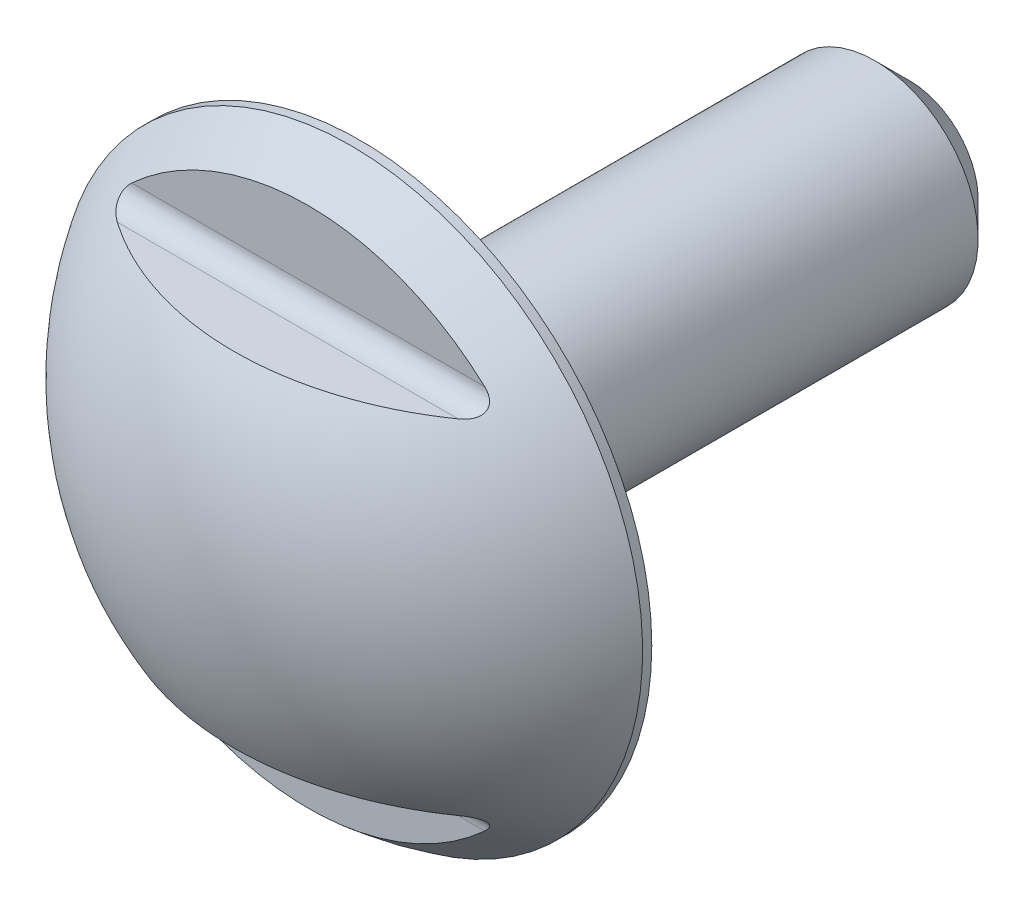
ISO-10303-21;
HEADER;
FILE_DESCRIPTION(('STEP AP214'),'2;1');
FILE_NAME('part.step','',(''),(''),'','','');
FILE_SCHEMA(('AUTOMOTIVE_DESIGN { 1 0 10303 214 1 1 1 1 }'));
ENDSEC;
DATA;
#1=APPLICATION_CONTEXT('core data for automotive mechanical design processes');
#2=APPLICATION_PROTOCOL_DEFINITION('international standard','automotive_design',2000,#1);
#3=PRODUCT_CONTEXT('',#1,'mechanical');
#4=PRODUCT('Part','Part','',(#3));
#5=PRODUCT_RELATED_PRODUCT_CATEGORY('part','',(#4));
#6=PRODUCT_DEFINITION_FORMATION('','',#4);
#7=PRODUCT_DEFINITION_CONTEXT('part definition',#1,'design');
#8=PRODUCT_DEFINITION('design','',#6,#7);
#9=PRODUCT_DEFINITION_SHAPE('','',#8);
#10=(LENGTH_UNIT() NAMED_UNIT(*) SI_UNIT(.MILLI.,.METRE.));
#11=(NAMED_UNIT(*) PLANE_ANGLE_UNIT() SI_UNIT($,.RADIAN.));
#12=(NAMED_UNIT(*) SI_UNIT($,.STERADIAN.) SOLID_ANGLE_UNIT());
#13=UNCERTAINTY_MEASURE_WITH_UNIT(LENGTH_MEASURE(1.E-05),#10,'distance_accuracy_value','');
#14=(GEOMETRIC_REPRESENTATION_CONTEXT(3) GLOBAL_UNCERTAINTY_ASSIGNED_CONTEXT((#13)) GLOBAL_UNIT_ASSIGNED_CONTEXT((#10,
#11,#12)) REPRESENTATION_CONTEXT('',''));
#15=CARTESIAN_POINT('',(0.,0.,0.));
#16=DIRECTION('',(0.,0.,1.));
#17=DIRECTION('',(1.,0.,0.));
#18=AXIS2_PLACEMENT_3D('',#15,#16,#17);
#19=CARTESIAN_POINT('',(0.,0.,-5.));
#20=DIRECTION('',(0.,0.,-1.));
#21=DIRECTION('',(0.,1.,0.));
#22=AXIS2_PLACEMENT_3D('',#19,#20,#21);
#23=SPHERICAL_SURFACE('',#22,10.);
#24=CARTESIAN_POINT('',(-4.9585441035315,5.00000003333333,2.1002));
#25=CARTESIAN_POINT('',(-4.97910716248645,5.00000243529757,2.0858379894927));
#26=CARTESIAN_POINT('',(-4.99945315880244,5.00050663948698,2.07114076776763));
#27=CARTESIAN_POINT('',(-5.03962102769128,5.0027138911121,2.0410018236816));
#28=CARTESIAN_POINT('',(-5.0594409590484,5.00442087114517,2.02555781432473));
#29=CARTESIAN_POINT('',(-5.09856220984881,5.0092602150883,1.99375610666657));
#30=CARTESIAN_POINT('',(-5.11785448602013,5.01240939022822,1.97738968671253));
#31=CARTESIAN_POINT('',(-5.15539462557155,5.02039881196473,1.94392893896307));
#32=CARTESIAN_POINT('',(-5.17364394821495,5.02523662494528,1.92683568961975));
#33=CARTESIAN_POINT('',(-5.2083955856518,5.03680791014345,1.89230014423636));
#34=CARTESIAN_POINT('',(-5.22492700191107,5.04349844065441,1.87487322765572));
#35=CARTESIAN_POINT('',(-5.25616977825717,5.05918155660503,1.83944291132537));
#36=CARTESIAN_POINT('',(-5.2708834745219,5.06817114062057,1.82144028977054));
#37=CARTESIAN_POINT('',(-5.29800007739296,5.08900635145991,1.78482466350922));
#38=CARTESIAN_POINT('',(-5.3103681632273,5.10088980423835,1.76620665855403));
#39=CARTESIAN_POINT('',(-5.33150201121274,5.12776957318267,1.72916760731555));
#40=CARTESIAN_POINT('',(-5.34027826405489,5.14275662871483,1.71074614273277));
#41=CARTESIAN_POINT('',(-5.35123329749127,5.17082101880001,1.68036107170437));
#42=CARTESIAN_POINT('',(-5.35460028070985,5.18312864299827,1.66811401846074));
#43=CARTESIAN_POINT('',(-5.35877261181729,5.20901124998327,1.64455174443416));
#44=CARTESIAN_POINT('',(-5.35957913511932,5.22258564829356,1.63323609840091));
#45=CARTESIAN_POINT('',(-5.35855478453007,5.25062821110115,1.61189118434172));
#46=CARTESIAN_POINT('',(-5.35672223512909,5.2650969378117,1.60186273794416));
#47=CARTESIAN_POINT('',(-5.35058554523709,5.29445902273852,1.58333115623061));
#48=CARTESIAN_POINT('',(-5.34628185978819,5.30935230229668,1.57482774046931));
#49=CARTESIAN_POINT('',(-5.33404114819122,5.34329195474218,1.55726630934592));
#50=CARTESIAN_POINT('',(-5.32542893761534,5.36234935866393,1.54870370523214));
#51=CARTESIAN_POINT('',(-5.30544866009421,5.40003907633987,1.53393504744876));
#52=CARTESIAN_POINT('',(-5.29406310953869,5.41866783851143,1.52774461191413));
#53=CARTESIAN_POINT('',(-5.26133859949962,5.46675764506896,1.51415757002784));
#54=CARTESIAN_POINT('',(-5.23828499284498,5.49554354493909,1.50851297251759));
#55=CARTESIAN_POINT('',(-5.20150205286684,5.53650777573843,1.50321404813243));
#56=CARTESIAN_POINT('',(-5.18899710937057,5.54968354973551,1.50197312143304));
#57=CARTESIAN_POINT('',(-5.16338098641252,5.57539598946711,1.50036793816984));
#58=CARTESIAN_POINT('',(-5.15027215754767,5.58793478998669,1.50000053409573));
#59=CARTESIAN_POINT('',(-5.13690174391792,5.6002,1.50000003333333));
#60=B_SPLINE_CURVE_WITH_KNOTS('',3,(#24,#25,#26,#27,#28,#29,#30,#31,#32,#33,#34,#35,#36,#37,#38,
#39,#40,#41,#42,#43,#44,#45,#46,#47,#48,#49,#50,#51,#52,#53,#54,#55,#56,#57,#58,#59),
.UNSPECIFIED.,.F.,.F.,(4,2,2,2,2,2,2,2,2,2,2,2,2,2,2,2,2,4),(0.,0.0752587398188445,
0.15076469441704,0.227174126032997,0.303473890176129,0.378135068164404,0.452699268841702,
0.528296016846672,0.603670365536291,0.656498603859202,0.709302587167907,0.76214010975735,
0.814967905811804,0.882385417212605,0.950239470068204,1.06140231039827,1.11600139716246,
1.17040345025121),.UNSPECIFIED.);
#61=CARTESIAN_POINT('',(-4.95883050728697,5.,2.1));
#62=VERTEX_POINT('',#61);
#63=CARTESIAN_POINT('',(-5.13711981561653,5.6,1.5));
#64=VERTEX_POINT('',#63);
#65=EDGE_CURVE('E65',#62,#64,#60,.T.);
#66=ORIENTED_EDGE('',*,*,#65,.T.);
#67=CARTESIAN_POINT('',(0.,0.,1.5));
#68=DIRECTION('',(0.,0.,1.));
#69=DIRECTION('',(1.,0.,0.));
#70=AXIS2_PLACEMENT_3D('',#67,#68,#69);
#71=CIRCLE('',#70,7.59934207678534);
#72=CARTESIAN_POINT('',(5.13711981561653,5.6,1.5));
#73=VERTEX_POINT('',#72);
#74=EDGE_CURVE('E53',#64,#73,#71,.F.);
#75=ORIENTED_EDGE('',*,*,#74,.T.);
#76=CARTESIAN_POINT('',(5.13690174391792,5.6002,1.50000003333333));
#77=CARTESIAN_POINT('',(5.16100622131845,5.57805722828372,1.5000319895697));
#78=CARTESIAN_POINT('',(5.18445655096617,5.55487857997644,1.50121737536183));
#79=CARTESIAN_POINT('',(5.22914155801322,5.50618309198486,1.50685277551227));
#80=CARTESIAN_POINT('',(5.25033446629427,5.48063460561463,1.51135506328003));
#81=CARTESIAN_POINT('',(5.28259809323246,5.43612392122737,1.522517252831));
#82=CARTESIAN_POINT('',(5.29473863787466,5.41766777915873,1.52802697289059));
#83=CARTESIAN_POINT('',(5.31645519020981,5.38018259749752,1.54136447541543));
#84=CARTESIAN_POINT('',(5.32604381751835,5.36115691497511,1.54918043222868));
#85=CARTESIAN_POINT('',(5.34043814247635,5.32655780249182,1.56565600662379));
#86=CARTESIAN_POINT('',(5.34580546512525,5.31101205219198,1.57387643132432));
#87=CARTESIAN_POINT('',(5.35397907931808,5.28021739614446,1.59200635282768));
#88=CARTESIAN_POINT('',(5.35678589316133,5.26496843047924,1.60191550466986));
#89=CARTESIAN_POINT('',(5.35958090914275,5.23522010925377,1.62326968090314));
#90=CARTESIAN_POINT('',(5.35955910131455,5.2207235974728,1.63472001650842));
#91=CARTESIAN_POINT('',(5.35667361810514,5.19301194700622,1.65875463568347));
#92=CARTESIAN_POINT('',(5.35380916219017,5.17979716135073,1.67133922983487));
#93=CARTESIAN_POINT('',(5.3457212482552,5.15559629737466,1.6965211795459));
#94=CARTESIAN_POINT('',(5.34062643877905,5.14453063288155,1.70908471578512));
#95=CARTESIAN_POINT('',(5.32847459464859,5.12390779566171,1.73448085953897));
#96=CARTESIAN_POINT('',(5.32141698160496,5.11435106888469,1.74731354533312));
#97=CARTESIAN_POINT('',(5.3009048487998,5.0913100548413,1.78083755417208));
#98=CARTESIAN_POINT('',(5.28617486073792,5.07898778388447,1.80154581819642));
#99=CARTESIAN_POINT('',(5.25383402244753,5.05761509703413,1.84240869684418));
#100=CARTESIAN_POINT('',(5.23621376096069,5.04857569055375,1.86256124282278));
#101=CARTESIAN_POINT('',(5.18615605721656,5.02789487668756,1.91565790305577));
#102=CARTESIAN_POINT('',(5.15188520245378,5.0187632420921,1.9478313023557));
#103=CARTESIAN_POINT('',(5.08021663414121,5.00602503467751,2.00952202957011));
#104=CARTESIAN_POINT('',(5.04281552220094,5.00242455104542,2.03903639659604));
#105=CARTESIAN_POINT('',(4.98927947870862,5.00028656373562,2.07845884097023));
#106=CARTESIAN_POINT('',(4.97397059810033,5.00000375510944,2.08942415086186));
#107=CARTESIAN_POINT('',(4.95854410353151,5.00000003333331,2.1002));
#108=B_SPLINE_CURVE_WITH_KNOTS('',3,(#76,#77,#78,#79,#80,#81,#82,#83,#84,#85,#86,#87,#88,#89,
#90,#91,#92,#93,#94,#95,#96,#97,#98,#99,#100,#101,#102,#103,#104,#105,#106,#107),.UNSPECIFIED.,
.F.,.F.,(4,2,2,2,2,2,2,2,2,2,2,2,2,2,2,4),(0.,0.0985065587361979,0.198599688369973,
0.266688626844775,0.334434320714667,0.389366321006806,0.444287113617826,0.499402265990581,
0.554532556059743,0.606832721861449,0.65914831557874,0.743388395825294,0.827908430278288,
0.970760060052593,1.11376884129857,1.17024331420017),.UNSPECIFIED.);
#109=CARTESIAN_POINT('',(4.95883050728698,5.,2.1));
#110=VERTEX_POINT('',#109);
#111=EDGE_CURVE('E58',#73,#110,#108,.T.);
#112=ORIENTED_EDGE('',*,*,#111,.T.);
#113=CARTESIAN_POINT('',(0.,5.,-5.));
#114=DIRECTION('',(0.,1.,0.));
#115=DIRECTION('',(0.,0.,1.));
#116=AXIS2_PLACEMENT_3D('',#113,#114,#115);
#117=CIRCLE('',#116,8.6602540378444);
#118=EDGE_CURVE('E70',#110,#62,#117,.F.);
#119=ORIENTED_EDGE('',*,*,#118,.T.);
#120=EDGE_LOOP('',(#66,#75,#112,#119));
#121=FACE_BOUND('',#120,.T.);
#122=CARTESIAN_POINT('',(0.,0.,0.267826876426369));
#123=DIRECTION('',(0.,0.,-1.));
#124=DIRECTION('',(-1.,0.,0.));
#125=AXIS2_PLACEMENT_3D('',#122,#123,#124);
#126=CIRCLE('',#125,8.5);
#127=CARTESIAN_POINT('',(-8.5,0.,0.267826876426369));
#128=VERTEX_POINT('',#127);
#129=EDGE_CURVE('E59',#128,#128,#126,.T.);
#130=ORIENTED_EDGE('',*,*,#129,.F.);
#131=EDGE_LOOP('',(#130));
#132=FACE_BOUND('',#131,.T.);
#133=CARTESIAN_POINT('',(4.9585441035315,-5.00000003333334,2.1002));
#134=CARTESIAN_POINT('',(4.97910716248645,-5.00000243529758,2.0858379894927));
#135=CARTESIAN_POINT('',(4.99945315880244,-5.00050663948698,2.07114076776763));
#136=CARTESIAN_POINT('',(5.03962102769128,-5.0027138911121,2.0410018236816));
#137=CARTESIAN_POINT('',(5.0594409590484,-5.00442087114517,2.02555781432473));
#138=CARTESIAN_POINT('',(5.09856220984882,-5.0092602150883,1.99375610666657));
#139=CARTESIAN_POINT('',(5.11785448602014,-5.01240939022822,1.97738968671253));
#140=CARTESIAN_POINT('',(5.15539462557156,-5.02039881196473,1.94392893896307));
#141=CARTESIAN_POINT('',(5.17364394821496,-5.02523662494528,1.92683568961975));
#142=CARTESIAN_POINT('',(5.2083955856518,-5.03680791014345,1.89230014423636));
#143=CARTESIAN_POINT('',(5.22492700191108,-5.04349844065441,1.87487322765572));
#144=CARTESIAN_POINT('',(5.25616977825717,-5.05918155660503,1.83944291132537));
#145=CARTESIAN_POINT('',(5.2708834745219,-5.06817114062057,1.82144028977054));
#146=CARTESIAN_POINT('',(5.29800007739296,-5.08900635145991,1.78482466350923));
#147=CARTESIAN_POINT('',(5.31036816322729,-5.10088980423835,1.76620665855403));
#148=CARTESIAN_POINT('',(5.33150201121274,-5.12776957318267,1.72916760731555));
#149=CARTESIAN_POINT('',(5.34027826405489,-5.14275662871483,1.71074614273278));
#150=CARTESIAN_POINT('',(5.35123329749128,-5.17082101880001,1.68036107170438));
#151=CARTESIAN_POINT('',(5.35460028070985,-5.18312864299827,1.66811401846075));
#152=CARTESIAN_POINT('',(5.3587726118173,-5.20901124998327,1.64455174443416));
#153=CARTESIAN_POINT('',(5.35957913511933,-5.22258564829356,1.63323609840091));
#154=CARTESIAN_POINT('',(5.35855478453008,-5.25062821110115,1.61189118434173));
#155=CARTESIAN_POINT('',(5.35672223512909,-5.2650969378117,1.60186273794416));
#156=CARTESIAN_POINT('',(5.35058554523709,-5.29445902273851,1.58333115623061));
#157=CARTESIAN_POINT('',(5.3462818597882,-5.30935230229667,1.57482774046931));
#158=CARTESIAN_POINT('',(5.33404114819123,-5.34329195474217,1.55726630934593));
#159=CARTESIAN_POINT('',(5.32542893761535,-5.36234935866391,1.54870370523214));
#160=CARTESIAN_POINT('',(5.30544866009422,-5.40003907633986,1.53393504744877));
#161=CARTESIAN_POINT('',(5.2940631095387,-5.41866783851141,1.52774461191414));
#162=CARTESIAN_POINT('',(5.26133859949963,-5.46675764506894,1.51415757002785));
#163=CARTESIAN_POINT('',(5.23828499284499,-5.49554354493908,1.50851297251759));
#164=CARTESIAN_POINT('',(5.20150205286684,-5.53650777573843,1.50321404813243));
#165=CARTESIAN_POINT('',(5.18899710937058,-5.54968354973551,1.50197312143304));
#166=CARTESIAN_POINT('',(5.16338098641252,-5.5753959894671,1.50036793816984));
#167=CARTESIAN_POINT('',(5.15027215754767,-5.58793478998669,1.50000053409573));
#168=CARTESIAN_POINT('',(5.13690174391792,-5.6002,1.50000003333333));
#169=B_SPLINE_CURVE_WITH_KNOTS('',3,(#133,#134,#135,#136,#137,#138,#139,#140,#141,#142,#143,
#144,#145,#146,#147,#148,#149,#150,#151,#152,#153,#154,#155,#156,#157,#158,#159,#160,#161,#162,
#163,#164,#165,#166,#167,#168),.UNSPECIFIED.,.F.,.F.,(4,2,2,2,2,2,2,2,2,2,2,2,2,2,2,2,2,4),(0.,
0.0752587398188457,0.150764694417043,0.227174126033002,0.303473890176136,0.378135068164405,
0.452699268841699,0.528296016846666,0.603670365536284,0.656498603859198,0.709302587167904,
0.762140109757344,0.814967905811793,0.882385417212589,0.950239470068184,1.06140231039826,
1.11600139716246,1.17040345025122),.UNSPECIFIED.);
#170=CARTESIAN_POINT('',(4.95883050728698,-5.,2.1));
#171=VERTEX_POINT('',#170);
#172=CARTESIAN_POINT('',(5.13711981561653,-5.6,1.5));
#173=VERTEX_POINT('',#172);
#174=EDGE_CURVE('E116',#171,#173,#169,.T.);
#175=ORIENTED_EDGE('',*,*,#174,.T.);
#176=CARTESIAN_POINT('',(0.,0.,1.5));
#177=DIRECTION('',(0.,0.,1.));
#178=DIRECTION('',(1.,0.,0.));
#179=AXIS2_PLACEMENT_3D('',#176,#177,#178);
#180=CIRCLE('',#179,7.59934207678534);
#181=CARTESIAN_POINT('',(-5.13711981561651,-5.6,1.5));
#182=VERTEX_POINT('',#181);
#183=EDGE_CURVE('E123',#173,#182,#180,.F.);
#184=ORIENTED_EDGE('',*,*,#183,.T.);
#185=CARTESIAN_POINT('',(-5.13690174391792,-5.6002,1.50000003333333));
#186=CARTESIAN_POINT('',(-5.16100622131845,-5.57805722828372,1.5000319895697));
#187=CARTESIAN_POINT('',(-5.18445655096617,-5.55487857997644,1.50121737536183));
#188=CARTESIAN_POINT('',(-5.22914155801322,-5.50618309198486,1.50685277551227));
#189=CARTESIAN_POINT('',(-5.25033446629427,-5.48063460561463,1.51135506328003));
#190=CARTESIAN_POINT('',(-5.28259809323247,-5.43612392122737,1.522517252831));
#191=CARTESIAN_POINT('',(-5.29473863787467,-5.41766777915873,1.52802697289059));
#192=CARTESIAN_POINT('',(-5.31645519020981,-5.38018259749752,1.54136447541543));
#193=CARTESIAN_POINT('',(-5.32604381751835,-5.36115691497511,1.54918043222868));
#194=CARTESIAN_POINT('',(-5.34043814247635,-5.32655780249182,1.56565600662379));
#195=CARTESIAN_POINT('',(-5.34580546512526,-5.31101205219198,1.57387643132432));
#196=CARTESIAN_POINT('',(-5.35397907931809,-5.28021739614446,1.59200635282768));
#197=CARTESIAN_POINT('',(-5.35678589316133,-5.26496843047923,1.60191550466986));
#198=CARTESIAN_POINT('',(-5.35958090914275,-5.23522010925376,1.62326968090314));
#199=CARTESIAN_POINT('',(-5.35955910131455,-5.22072359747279,1.63472001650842));
#200=CARTESIAN_POINT('',(-5.35667361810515,-5.19301194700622,1.65875463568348));
#201=CARTESIAN_POINT('',(-5.35380916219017,-5.17979716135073,1.67133922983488));
#202=CARTESIAN_POINT('',(-5.3457212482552,-5.15559629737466,1.69652117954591));
#203=CARTESIAN_POINT('',(-5.34062643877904,-5.14453063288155,1.70908471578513));
#204=CARTESIAN_POINT('',(-5.32847459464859,-5.1239077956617,1.73448085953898));
#205=CARTESIAN_POINT('',(-5.32141698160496,-5.11435106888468,1.74731354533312));
#206=CARTESIAN_POINT('',(-5.3009048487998,-5.09131005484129,1.78083755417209));
#207=CARTESIAN_POINT('',(-5.28617486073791,-5.07898778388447,1.80154581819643));
#208=CARTESIAN_POINT('',(-5.25383402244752,-5.05761509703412,1.84240869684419));
#209=CARTESIAN_POINT('',(-5.23621376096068,-5.04857569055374,1.8625612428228));
#210=CARTESIAN_POINT('',(-5.18615605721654,-5.02789487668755,1.91565790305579));
#211=CARTESIAN_POINT('',(-5.15188520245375,-5.01876324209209,1.94783130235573));
#212=CARTESIAN_POINT('',(-5.08021663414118,-5.00602503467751,2.00952202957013));
#213=CARTESIAN_POINT('',(-5.04281552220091,-5.00242455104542,2.03903639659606));
#214=CARTESIAN_POINT('',(-4.98927947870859,-5.00028656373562,2.07845884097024));
#215=CARTESIAN_POINT('',(-4.97397059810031,-5.00000375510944,2.08942415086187));
#216=CARTESIAN_POINT('',(-4.95854410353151,-5.00000003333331,2.1002));
#217=B_SPLINE_CURVE_WITH_KNOTS('',3,(#185,#186,#187,#188,#189,#190,#191,#192,#193,#194,#195,
#196,#197,#198,#199,#200,#201,#202,#203,#204,#205,#206,#207,#208,#209,#210,#211,#212,#213,#214,
#215,#216),.UNSPECIFIED.,.F.,.F.,(4,2,2,2,2,2,2,2,2,2,2,2,2,2,2,4),(0.,0.0985065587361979,
0.198599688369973,0.266688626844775,0.334434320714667,0.389366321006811,0.444287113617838,
0.49940226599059,0.554532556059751,0.606832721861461,0.659148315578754,0.743388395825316,
0.827908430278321,0.970760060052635,1.11376884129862,1.17024331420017),.UNSPECIFIED.);
#218=CARTESIAN_POINT('',(-4.95883050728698,-5.,2.1));
#219=VERTEX_POINT('',#218);
#220=EDGE_CURVE('E110',#182,#219,#217,.T.);
#221=ORIENTED_EDGE('',*,*,#220,.T.);
#222=CARTESIAN_POINT('',(0.,-5.,-5.));
#223=DIRECTION('',(0.,-1.,0.));
#224=DIRECTION('',(0.,0.,-1.));
#225=AXIS2_PLACEMENT_3D('',#222,#223,#224);
#226=CIRCLE('',#225,8.6602540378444);
#227=EDGE_CURVE('E72',#219,#171,#226,.F.);
#228=ORIENTED_EDGE('',*,*,#227,.T.);
#229=EDGE_LOOP('',(#175,#184,#221,#228));
#230=FACE_BOUND('',#229,.T.);
#231=ADVANCED_FACE('F14',(#121,#132,#230),#23,.T.);
#232=CARTESIAN_POINT('',(0.,0.,-10.));
#233=DIRECTION('',(0.,0.,-1.));
#234=DIRECTION('',(-1.,0.,0.));
#235=AXIS2_PLACEMENT_3D('',#232,#233,#234);
#236=CYLINDRICAL_SURFACE('',#235,8.5);
#237=CARTESIAN_POINT('',(0.,0.,0.));
#238=DIRECTION('',(0.,0.,-1.));
#239=DIRECTION('',(-1.,0.,0.));
#240=AXIS2_PLACEMENT_3D('',#237,#238,#239);
#241=CIRCLE('',#240,8.5);
#242=CARTESIAN_POINT('',(-8.5,0.,0.));
#243=VERTEX_POINT('',#242);
#244=EDGE_CURVE('E194',#243,#243,#241,.T.);
#245=ORIENTED_EDGE('',*,*,#244,.F.);
#246=EDGE_LOOP('',(#245));
#247=FACE_BOUND('',#246,.T.);
#248=ORIENTED_EDGE('',*,*,#129,.T.);
#249=EDGE_LOOP('',(#248));
#250=FACE_BOUND('',#249,.T.);
#251=ADVANCED_FACE('F137',(#247,#250),#236,.T.);
#252=CARTESIAN_POINT('',(0.,8.5,0.));
#253=DIRECTION('',(0.,0.,1.));
#254=DIRECTION('',(1.,0.,0.));
#255=AXIS2_PLACEMENT_3D('',#252,#253,#254);
#256=PLANE('',#255);
#257=CARTESIAN_POINT('',(0.,0.,0.));
#258=DIRECTION('',(0.,0.,-1.));
#259=DIRECTION('',(-1.,0.,0.));
#260=AXIS2_PLACEMENT_3D('',#257,#258,#259);
#261=CIRCLE('',#260,2.7);
#262=CARTESIAN_POINT('',(-2.7,0.,0.));
#263=VERTEX_POINT('',#262);
#264=EDGE_CURVE('E191',#263,#263,#261,.T.);
#265=ORIENTED_EDGE('',*,*,#264,.F.);
#266=EDGE_LOOP('',(#265));
#267=FACE_BOUND('',#266,.T.);
#268=ORIENTED_EDGE('',*,*,#244,.T.);
#269=EDGE_LOOP('',(#268));
#270=FACE_BOUND('',#269,.T.);
#271=ADVANCED_FACE('F141',(#267,#270),#256,.F.);
#272=CARTESIAN_POINT('',(0.,0.,-0.5));
#273=DIRECTION('',(0.,0.,-1.));
#274=DIRECTION('',(-1.,0.,0.));
#275=AXIS2_PLACEMENT_3D('',#272,#273,#274);
#276=TOROIDAL_SURFACE('',#275,2.7,0.5);
#277=CARTESIAN_POINT('',(0.,0.,-0.5));
#278=DIRECTION('',(0.,0.,-1.));
#279=DIRECTION('',(-1.,0.,0.));
#280=AXIS2_PLACEMENT_3D('',#277,#278,#279);
#281=CIRCLE('',#280,2.2);
#282=CARTESIAN_POINT('',(-2.2,0.,-0.5));
#283=VERTEX_POINT('',#282);
#284=EDGE_CURVE('E188',#283,#283,#281,.T.);
#285=ORIENTED_EDGE('',*,*,#284,.F.);
#286=EDGE_LOOP('',(#285));
#287=FACE_BOUND('',#286,.T.);
#288=ORIENTED_EDGE('',*,*,#264,.T.);
#289=EDGE_LOOP('',(#288));
#290=FACE_BOUND('',#289,.T.);
#291=ADVANCED_FACE('F146',(#287,#290),#276,.F.);
#292=CARTESIAN_POINT('',(0.,0.,-10.));
#293=DIRECTION('',(0.,0.,-1.));
#294=DIRECTION('',(-1.,0.,0.));
#295=AXIS2_PLACEMENT_3D('',#292,#293,#294);
#296=CYLINDRICAL_SURFACE('',#295,2.2);
#297=CARTESIAN_POINT('',(0.,0.,-0.580384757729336));
#298=DIRECTION('',(0.,0.,-1.));
#299=DIRECTION('',(-1.,0.,0.));
#300=AXIS2_PLACEMENT_3D('',#297,#298,#299);
#301=CIRCLE('',#300,2.2);
#302=CARTESIAN_POINT('',(-2.2,0.,-0.580384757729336));
#303=VERTEX_POINT('',#302);
#304=EDGE_CURVE('E180',#303,#303,#301,.T.);
#305=ORIENTED_EDGE('',*,*,#304,.F.);
#306=EDGE_LOOP('',(#305));
#307=FACE_BOUND('',#306,.T.);
#308=ORIENTED_EDGE('',*,*,#284,.T.);
#309=EDGE_LOOP('',(#308));
#310=FACE_BOUND('',#309,.T.);
#311=ADVANCED_FACE('F154',(#307,#310),#296,.T.);
#312=CARTESIAN_POINT('',(0.,0.,-0.580384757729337));
#313=DIRECTION('',(0.,0.,-1.));
#314=DIRECTION('',(-1.,0.,0.));
#315=AXIS2_PLACEMENT_3D('',#312,#313,#314);
#316=TOROIDAL_SURFACE('',#315,2.7,0.5);
#317=CARTESIAN_POINT('',(0.,0.,-0.830384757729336));
#318=DIRECTION('',(0.,0.,-1.));
#319=DIRECTION('',(-1.,0.,0.));
#320=AXIS2_PLACEMENT_3D('',#317,#318,#319);
#321=CIRCLE('',#320,2.26698729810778);
#322=CARTESIAN_POINT('',(-2.26698729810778,0.,-0.830384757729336));
#323=VERTEX_POINT('',#322);
#324=EDGE_CURVE('E176',#323,#323,#321,.T.);
#325=ORIENTED_EDGE('',*,*,#324,.F.);
#326=EDGE_LOOP('',(#325));
#327=FACE_BOUND('',#326,.T.);
#328=ORIENTED_EDGE('',*,*,#304,.T.);
#329=EDGE_LOOP('',(#328));
#330=FACE_BOUND('',#329,.T.);
#331=ADVANCED_FACE('F158',(#327,#330),#316,.F.);
#332=CARTESIAN_POINT('',(0.,0.,-0.830384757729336));
#333=DIRECTION('',(0.,0.,-1.));
#334=DIRECTION('',(-1.,0.,0.));
#335=AXIS2_PLACEMENT_3D('',#332,#333,#334);
#336=CONICAL_SURFACE('',#335,2.26698729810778,0.523598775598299);
#337=CARTESIAN_POINT('',(0.,0.,-2.1));
#338=DIRECTION('',(0.,0.,-1.));
#339=DIRECTION('',(-1.,0.,0.));
#340=AXIS2_PLACEMENT_3D('',#337,#338,#339);
#341=CIRCLE('',#340,3.);
#342=CARTESIAN_POINT('',(-3.,0.,-2.1));
#343=VERTEX_POINT('',#342);
#344=EDGE_CURVE('E175',#343,#343,#341,.T.);
#345=ORIENTED_EDGE('',*,*,#344,.F.);
#346=EDGE_LOOP('',(#345));
#347=FACE_BOUND('',#346,.T.);
#348=ORIENTED_EDGE('',*,*,#324,.T.);
#349=EDGE_LOOP('',(#348));
#350=FACE_BOUND('',#349,.T.);
#351=ADVANCED_FACE('F162',(#347,#350),#336,.T.);
#352=CARTESIAN_POINT('',(0.,0.,-10.));
#353=DIRECTION('',(0.,0.,-1.));
#354=DIRECTION('',(-1.,0.,0.));
#355=AXIS2_PLACEMENT_3D('',#352,#353,#354);
#356=CYLINDRICAL_SURFACE('',#355,3.);
#357=CARTESIAN_POINT('',(0.,0.,-15.));
#358=DIRECTION('',(0.,0.,-1.));
#359=DIRECTION('',(-1.,0.,0.));
#360=AXIS2_PLACEMENT_3D('',#357,#358,#359);
#361=CIRCLE('',#360,3.);
#362=CARTESIAN_POINT('',(-3.,0.,-15.));
#363=VERTEX_POINT('',#362);
#364=EDGE_CURVE('E9',#363,#363,#361,.F.);
#365=ORIENTED_EDGE('',*,*,#364,.T.);
#366=EDGE_LOOP('',(#365));
#367=FACE_BOUND('',#366,.T.);
#368=ORIENTED_EDGE('',*,*,#344,.T.);
#369=EDGE_LOOP('',(#368));
#370=FACE_BOUND('',#369,.T.);
#371=ADVANCED_FACE('F165',(#367,#370),#356,.T.);
#372=CARTESIAN_POINT('',(10.5,5.6,1.5));
#373=DIRECTION('',(0.,0.,1.));
#374=DIRECTION('',(1.,0.,0.));
#375=AXIS2_PLACEMENT_3D('',#372,#373,#374);
#376=PLANE('',#375);
#377=DIRECTION('',(-1.,0.,0.));
#378=VECTOR('',#377,1.);
#379=CARTESIAN_POINT('',(10.5,5.6,1.5));
#380=LINE('',#379,#378);
#381=EDGE_CURVE('E35',#73,#64,#380,.T.);
#382=ORIENTED_EDGE('',*,*,#381,.F.);
#383=ORIENTED_EDGE('',*,*,#74,.F.);
#384=EDGE_LOOP('',(#382,#383));
#385=FACE_BOUND('',#384,.T.);
#386=ADVANCED_FACE('F54',(#385),#376,.T.);
#387=CARTESIAN_POINT('',(10.5,5.6,2.1));
#388=DIRECTION('',(-1.,0.,0.));
#389=DIRECTION('',(0.,-1.,0.));
#390=AXIS2_PLACEMENT_3D('',#387,#388,#389);
#391=CYLINDRICAL_SURFACE('',#390,0.6);
#392=DIRECTION('',(-1.,0.,0.));
#393=VECTOR('',#392,1.);
#394=CARTESIAN_POINT('',(10.5,5.,2.1));
#395=LINE('',#394,#393);
#396=EDGE_CURVE('E67',#110,#62,#395,.T.);
#397=ORIENTED_EDGE('',*,*,#396,.F.);
#398=ORIENTED_EDGE('',*,*,#111,.F.);
#399=ORIENTED_EDGE('',*,*,#381,.T.);
#400=ORIENTED_EDGE('',*,*,#65,.F.);
#401=EDGE_LOOP('',(#397,#398,#399,#400));
#402=FACE_BOUND('',#401,.T.);
#403=ADVANCED_FACE('F64',(#402),#391,.F.);
#404=CARTESIAN_POINT('',(10.5,5.,5.));
#405=DIRECTION('',(0.,1.,0.));
#406=DIRECTION('',(0.,0.,1.));
#407=AXIS2_PLACEMENT_3D('',#404,#405,#406);
#408=PLANE('',#407);
#409=ORIENTED_EDGE('',*,*,#118,.F.);
#410=ORIENTED_EDGE('',*,*,#396,.T.);
#411=EDGE_LOOP('',(#409,#410));
#412=FACE_BOUND('',#411,.T.);
#413=ADVANCED_FACE('F91',(#412),#408,.T.);
#414=CARTESIAN_POINT('',(10.5,-13.5,1.5));
#415=DIRECTION('',(0.,0.,1.));
#416=DIRECTION('',(1.,0.,0.));
#417=AXIS2_PLACEMENT_3D('',#414,#415,#416);
#418=PLANE('',#417);
#419=DIRECTION('',(-1.,0.,0.));
#420=VECTOR('',#419,1.);
#421=CARTESIAN_POINT('',(10.5,-5.6,1.5));
#422=LINE('',#421,#420);
#423=EDGE_CURVE('E177',#173,#182,#422,.T.);
#424=ORIENTED_EDGE('',*,*,#423,.T.);
#425=ORIENTED_EDGE('',*,*,#183,.F.);
#426=EDGE_LOOP('',(#424,#425));
#427=FACE_BOUND('',#426,.T.);
#428=ADVANCED_FACE('F96',(#427),#418,.T.);
#429=CARTESIAN_POINT('',(10.5,-5.6,2.1));
#430=DIRECTION('',(-1.,0.,0.));
#431=DIRECTION('',(0.,-1.,0.));
#432=AXIS2_PLACEMENT_3D('',#429,#430,#431);
#433=CYLINDRICAL_SURFACE('',#432,0.6);
#434=DIRECTION('',(-1.,0.,0.));
#435=VECTOR('',#434,1.);
#436=CARTESIAN_POINT('',(10.5,-5.,2.1));
#437=LINE('',#436,#435);
#438=EDGE_CURVE('E28',#171,#219,#437,.T.);
#439=ORIENTED_EDGE('',*,*,#438,.T.);
#440=ORIENTED_EDGE('',*,*,#220,.F.);
#441=ORIENTED_EDGE('',*,*,#423,.F.);
#442=ORIENTED_EDGE('',*,*,#174,.F.);
#443=EDGE_LOOP('',(#439,#440,#441,#442));
#444=FACE_BOUND('',#443,.T.);
#445=ADVANCED_FACE('F102',(#444),#433,.F.);
#446=CARTESIAN_POINT('',(10.5,-5.,2.1));
#447=DIRECTION('',(0.,-1.,0.));
#448=DIRECTION('',(0.,0.,-1.));
#449=AXIS2_PLACEMENT_3D('',#446,#447,#448);
#450=PLANE('',#449);
#451=ORIENTED_EDGE('',*,*,#438,.F.);
#452=ORIENTED_EDGE('',*,*,#227,.F.);
#453=EDGE_LOOP('',(#451,#452));
#454=FACE_BOUND('',#453,.T.);
#455=ADVANCED_FACE('F98',(#454),#450,.T.);
#456=CARTESIAN_POINT('',(0.,0.,-16.));
#457=DIRECTION('',(0.,0.,-1.));
#458=DIRECTION('',(-1.,0.,0.));
#459=AXIS2_PLACEMENT_3D('',#456,#457,#458);
#460=PLANE('',#459);
#461=CARTESIAN_POINT('',(0.,0.,-16.));
#462=DIRECTION('',(0.,0.,-1.));
#463=DIRECTION('',(-1.,0.,0.));
#464=AXIS2_PLACEMENT_3D('',#461,#462,#463);
#465=CIRCLE('',#464,2.);
#466=CARTESIAN_POINT('',(-2.,0.,-16.));
#467=VERTEX_POINT('',#466);
#468=EDGE_CURVE('E22',#467,#467,#465,.T.);
#469=ORIENTED_EDGE('',*,*,#468,.T.);
#470=EDGE_LOOP('',(#469));
#471=FACE_BOUND('',#470,.T.);
#472=ADVANCED_FACE('F101',(#471),#460,.T.);
#473=CARTESIAN_POINT('',(0.,0.,-16.));
#474=DIRECTION('',(0.,0.,1.));
#475=DIRECTION('',(1.,0.,0.));
#476=AXIS2_PLACEMENT_3D('',#473,#474,#475);
#477=CONICAL_SURFACE('',#476,2.,0.785398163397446);
#478=ORIENTED_EDGE('',*,*,#364,.F.);
#479=EDGE_LOOP('',(#478));
#480=FACE_BOUND('',#479,.T.);
#481=ORIENTED_EDGE('',*,*,#468,.F.);
#482=EDGE_LOOP('',(#481));
#483=FACE_BOUND('',#482,.T.);
#484=ADVANCED_FACE('F16',(#480,#483),#477,.T.);
#485=CLOSED_SHELL('',(#231,#251,#271,#291,#311,#331,#351,#371,#386,#403,#413,#428,#445,#455,
#472,#484));
#486=MANIFOLD_SOLID_BREP('B1',#485);
#487=ADVANCED_BREP_SHAPE_REPRESENTATION('',(#18,#486),#14);
#488=SHAPE_DEFINITION_REPRESENTATION(#9,#487);
ENDSEC;
END-ISO-10303-21;
